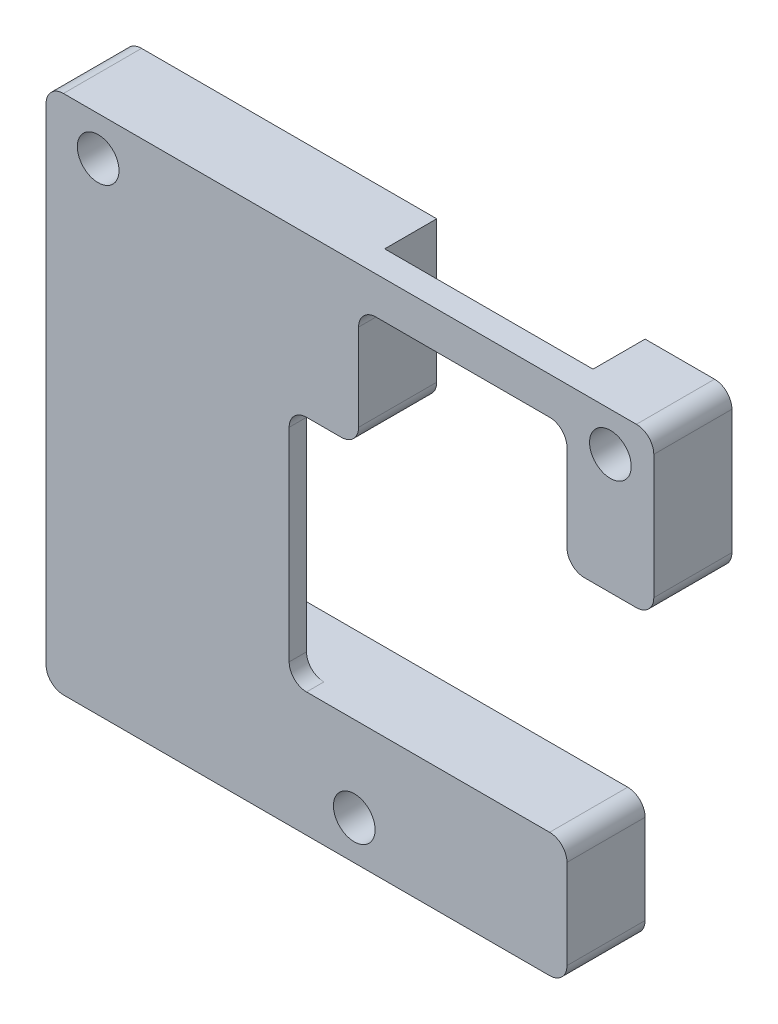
from build123d import *

# Parameters (mm, degrees)
BOSS_EXTRUDE1_DEPTH   = 3.5
SKETCH2_W             = 30
SKETCH2_H             = 7.15
BOSS_EXTRUDE1_2_DEPTH = 3.5
SKETCH3_W             = 14
SKETCH3_H             = 30
BOSS_EXTRUDE2_DEPTH   = 1
SKETCH5_W             = 16
SKETCH5_H             = 7.15
BOSS_EXTRUDE3_DEPTH   = 1
SKETCH7_R             = 1.2
CUT_EXTRUDE1_DEPTH    = 43.398231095
SKETCH11_W            = 12
SKETCH11_H            = 3
CUT_EXTRUDE4_DEPTH    = 49.458564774
FILLET2_R             = 1


with BuildPart() as part:
    # Sketch2 → Boss-Extrude1 (new body)
    with BuildSketch(Plane.XY):
        Polygon((4.4, 15), (22.4, 15), (34.4, 15), (39.4, 15), (39.4, 5.85), (34.4, 5.85), (34.4, 12.85), (22.4, 12.85), (22.4, 5.85), (4.4, 5.85), align=None)
    extrude(amount=BOSS_EXTRUDE1_DEPTH)



with BuildPart() as body_2:
    # Sketch2 → Boss-Extrude1 2 (new body)
    with BuildSketch(Plane.XY):
        with Locations((19.4, -11.425)):
            Rectangle(SKETCH2_W, SKETCH2_H)
    extrude(amount=BOSS_EXTRUDE1_2_DEPTH)


with BuildPart() as part_1:
    add(part.part)

    add(body_2.part)  # Boss-Extrude2 merges body 2
    # Sketch3 → Boss-Extrude2 (add)
    with BuildSketch(Plane.XY.offset(3.5)):
        with Locations((11.4, 0)):
            Rectangle(SKETCH3_W, SKETCH3_H)
    extrude(amount=BOSS_EXTRUDE2_DEPTH)

    # Sketch5 → Boss-Extrude3 (add)
    with BuildSketch(Plane.XY.offset(3.5)):
        with Locations((26.4, -11.425)):
            Rectangle(SKETCH5_W, SKETCH5_H)
        Polygon((18.4, 15), (18.4, 5.85), (22.4, 5.85), (22.4, 12.85), (34.4, 12.85), (34.4, 5.85), (39.4, 5.85), (39.4, 15), align=None)
    extrude(amount=BOSS_EXTRUDE3_DEPTH)

    # Sketch7 → Cut-Extrude1 (cut, through all)
    with BuildSketch(Plane.XY.offset(4.5)):
        with Locations((7.4, 12.75)):
            Circle(SKETCH7_R)
        with Locations((36.9, 12.75)):
            Circle(SKETCH7_R)
        with Locations((22.15, -12.75)):
            Circle(SKETCH7_R)
    extrude(amount=-CUT_EXTRUDE1_DEPTH, mode=Mode.SUBTRACT)

    # Sketch11 → Cut-Extrude4 (cut, through all)
    with BuildSketch(Plane.XZ.offset(-12.85)):
        with Locations((28.4, 1.5)):
            Rectangle(SKETCH11_W, SKETCH11_H)
    extrude(amount=-CUT_EXTRUDE4_DEPTH, mode=Mode.SUBTRACT)

    # Fillet2
    fillet2_edges = [part_1.edges().sort_by_distance(p)[0] for p in [
        (4.4, 15, 2.25),
        (39.4, 15, 2.25),
        (39.4, 5.85, 2.25),
        (34.4, 5.85, 2.25),
        (34.4, 12.85, 3.75),
        (22.4, 12.85, 3.75),
        (22.4, 5.85, 2.25),
        (4.4, -15, 2.25),
        (34.4, -15, 2.25),
        (34.4, -7.85, 2.25),
        (18.4, -7.85, 4),
        (18.4, 5.85, 4),
    ]]
    fillet(fillet2_edges, radius=FILLET2_R)


solid = part_1.part
